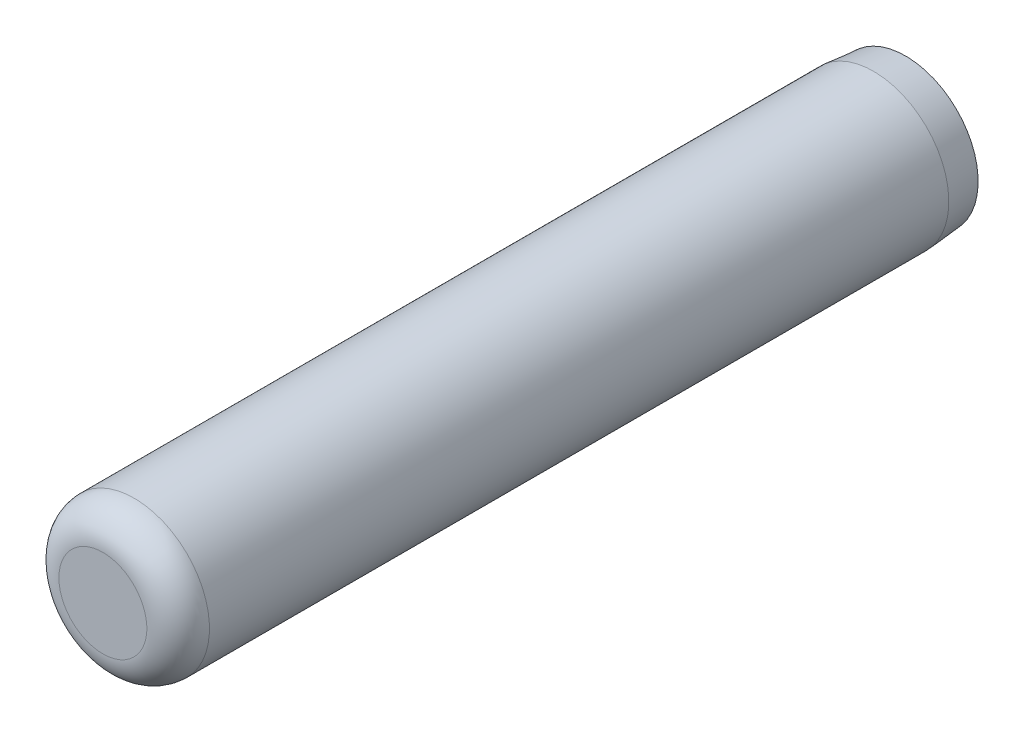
from build123d import *


with BuildPart() as part:
    # Logo3_bib1 → Revolve1 (revolve)
    with BuildSketch(Plane(origin=(0, 0, 0), x_dir=(-1, 0, 0), z_dir=(0, -1, 0))):
        with BuildLine():
            Line((0, 19.05), (0, -31.75))
            Line((0, -31.75), (2.7813, -31.75))
            ThreePointArc((2.7813, -31.75), (4.182219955, -31.169719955), (4.7625, -29.7688))
            Line((4.7625, -29.7688), (4.7625, 17.018))
            Line((4.7625, 17.018), (4.584723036, 19.05))
            Line((4.584723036, 19.05), (0, 19.05))
        make_face()
    revolve(axis=Axis((0, 0, -47.537203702), (0, 0, 1)))


solid = part.part
